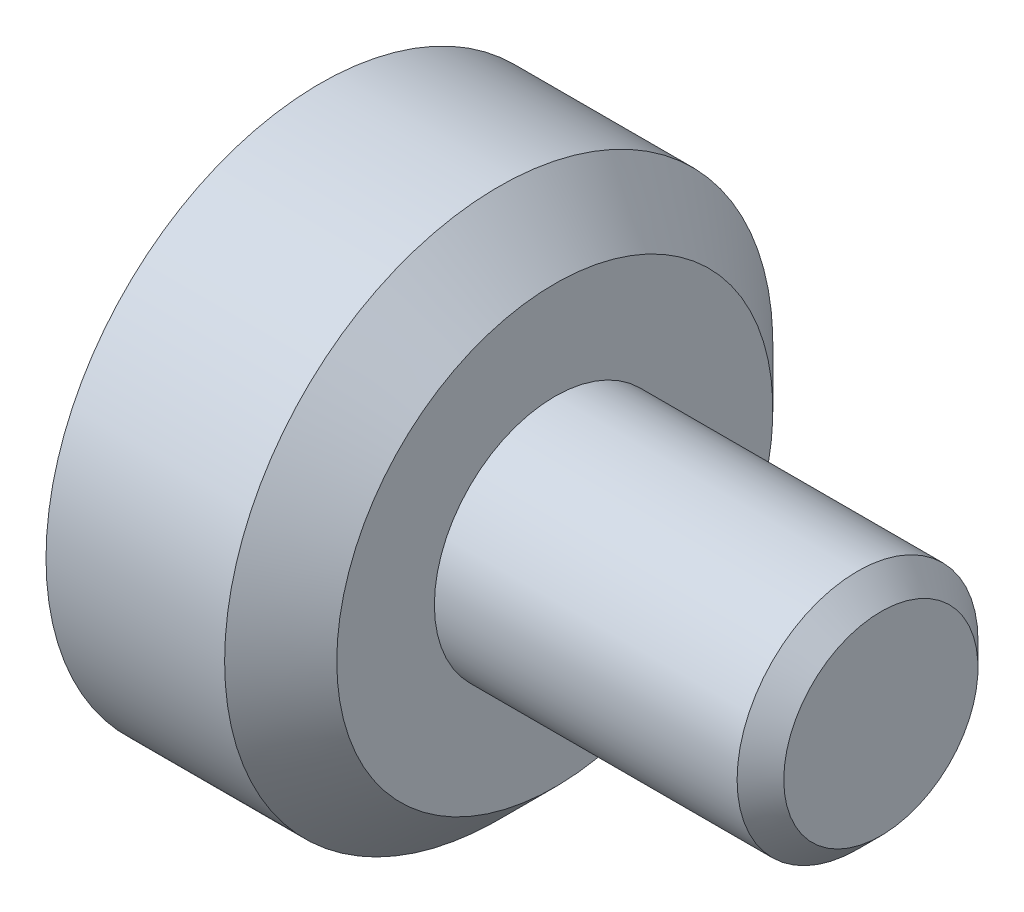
ISO-10303-21;
HEADER;
FILE_DESCRIPTION(('STEP AP214'),'2;1');
FILE_NAME('part.step','',(''),(''),'','','');
FILE_SCHEMA(('AUTOMOTIVE_DESIGN { 1 0 10303 214 1 1 1 1 }'));
ENDSEC;
DATA;
#1=APPLICATION_CONTEXT('core data for automotive mechanical design processes');
#2=APPLICATION_PROTOCOL_DEFINITION('international standard','automotive_design',2000,#1);
#3=PRODUCT_CONTEXT('',#1,'mechanical');
#4=PRODUCT('Part','Part','',(#3));
#5=PRODUCT_RELATED_PRODUCT_CATEGORY('part','',(#4));
#6=PRODUCT_DEFINITION_FORMATION('','',#4);
#7=PRODUCT_DEFINITION_CONTEXT('part definition',#1,'design');
#8=PRODUCT_DEFINITION('design','',#6,#7);
#9=PRODUCT_DEFINITION_SHAPE('','',#8);
#10=(LENGTH_UNIT() NAMED_UNIT(*) SI_UNIT(.MILLI.,.METRE.));
#11=(NAMED_UNIT(*) PLANE_ANGLE_UNIT() SI_UNIT($,.RADIAN.));
#12=(NAMED_UNIT(*) SI_UNIT($,.STERADIAN.) SOLID_ANGLE_UNIT());
#13=UNCERTAINTY_MEASURE_WITH_UNIT(LENGTH_MEASURE(1.E-05),#10,'distance_accuracy_value','');
#14=(GEOMETRIC_REPRESENTATION_CONTEXT(3) GLOBAL_UNCERTAINTY_ASSIGNED_CONTEXT((#13)) GLOBAL_UNIT_ASSIGNED_CONTEXT((#10,
#11,#12)) REPRESENTATION_CONTEXT('',''));
#15=CARTESIAN_POINT('',(0.,0.,0.));
#16=DIRECTION('',(0.,0.,1.));
#17=DIRECTION('',(1.,0.,0.));
#18=AXIS2_PLACEMENT_3D('',#15,#16,#17);
#19=CARTESIAN_POINT('',(-42.0062518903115,0.,0.));
#20=DIRECTION('',(1.,0.,0.));
#21=DIRECTION('',(0.,0.,-1.));
#22=AXIS2_PLACEMENT_3D('',#19,#20,#21);
#23=PLANE('',#22);
#24=CARTESIAN_POINT('',(-42.0062518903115,0.,0.));
#25=DIRECTION('',(-1.,0.,0.));
#26=DIRECTION('',(0.,0.,1.));
#27=AXIS2_PLACEMENT_3D('',#24,#25,#26);
#28=CIRCLE('',#27,58.7200549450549);
#29=CARTESIAN_POINT('',(-42.0062518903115,0.,58.7200549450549));
#30=VERTEX_POINT('',#29);
#31=EDGE_CURVE('E42',#30,#30,#28,.T.);
#32=ORIENTED_EDGE('',*,*,#31,.T.);
#33=EDGE_LOOP('',(#32));
#34=FACE_BOUND('',#33,.T.);
#35=ADVANCED_FACE('F31',(#34),#23,.F.);
#36=CARTESIAN_POINT('',(-54.4620211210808,0.,0.));
#37=DIRECTION('',(-1.,0.,0.));
#38=DIRECTION('',(0.,0.,1.));
#39=AXIS2_PLACEMENT_3D('',#36,#37,#38);
#40=CYLINDRICAL_SURFACE('',#39,58.7200549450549);
#41=ORIENTED_EDGE('',*,*,#31,.F.);
#42=EDGE_LOOP('',(#41));
#43=FACE_BOUND('',#42,.T.);
#44=CARTESIAN_POINT('',(-3.74924639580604,0.,0.));
#45=DIRECTION('',(-1.,0.,0.));
#46=DIRECTION('',(0.,0.,1.));
#47=AXIS2_PLACEMENT_3D('',#44,#45,#46);
#48=CIRCLE('',#47,58.7200549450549);
#49=CARTESIAN_POINT('',(-3.74924639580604,0.,58.7200549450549));
#50=VERTEX_POINT('',#49);
#51=EDGE_CURVE('E46',#50,#50,#48,.T.);
#52=ORIENTED_EDGE('',*,*,#51,.T.);
#53=EDGE_LOOP('',(#52));
#54=FACE_BOUND('',#53,.T.);
#55=ADVANCED_FACE('F73',(#43,#54),#40,.T.);
#56=CARTESIAN_POINT('',(8.26167393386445,0.,0.));
#57=DIRECTION('',(-1.,0.,0.));
#58=DIRECTION('',(0.,0.,1.));
#59=AXIS2_PLACEMENT_3D('',#56,#57,#58);
#60=CONICAL_SURFACE('',#59,46.7091346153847,0.785398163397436);
#61=ORIENTED_EDGE('',*,*,#51,.F.);
#62=EDGE_LOOP('',(#61));
#63=FACE_BOUND('',#62,.T.);
#64=CARTESIAN_POINT('',(8.26167393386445,0.,0.));
#65=DIRECTION('',(-1.,0.,0.));
#66=DIRECTION('',(0.,0.,1.));
#67=AXIS2_PLACEMENT_3D('',#64,#65,#66);
#68=CIRCLE('',#67,46.7091346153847);
#69=CARTESIAN_POINT('',(8.26167393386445,0.,46.7091346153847));
#70=VERTEX_POINT('',#69);
#71=EDGE_CURVE('E51',#70,#70,#68,.T.);
#72=ORIENTED_EDGE('',*,*,#71,.T.);
#73=EDGE_LOOP('',(#72));
#74=FACE_BOUND('',#73,.T.);
#75=ADVANCED_FACE('F69',(#63,#74),#60,.T.);
#76=CARTESIAN_POINT('',(8.26167393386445,46.7091346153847,0.));
#77=DIRECTION('',(-1.,0.,0.));
#78=DIRECTION('',(0.,0.,1.));
#79=AXIS2_PLACEMENT_3D('',#76,#77,#78);
#80=PLANE('',#79);
#81=ORIENTED_EDGE('',*,*,#71,.F.);
#82=EDGE_LOOP('',(#81));
#83=FACE_BOUND('',#82,.T.);
#84=CARTESIAN_POINT('',(8.26167393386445,0.,0.));
#85=DIRECTION('',(-1.,0.,0.));
#86=DIRECTION('',(0.,0.,1.));
#87=AXIS2_PLACEMENT_3D('',#84,#85,#86);
#88=CIRCLE('',#87,25.8012362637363);
#89=CARTESIAN_POINT('',(8.26167393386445,0.,25.8012362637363));
#90=VERTEX_POINT('',#89);
#91=EDGE_CURVE('E54',#90,#90,#88,.T.);
#92=ORIENTED_EDGE('',*,*,#91,.T.);
#93=EDGE_LOOP('',(#92));
#94=FACE_BOUND('',#93,.T.);
#95=ADVANCED_FACE('F58',(#83,#94),#80,.F.);
#96=CARTESIAN_POINT('',(-54.4620211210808,0.,0.));
#97=DIRECTION('',(-1.,0.,0.));
#98=DIRECTION('',(0.,0.,1.));
#99=AXIS2_PLACEMENT_3D('',#96,#97,#98);
#100=CYLINDRICAL_SURFACE('',#99,25.8012362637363);
#101=CARTESIAN_POINT('',(73.1029514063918,0.,0.));
#102=DIRECTION('',(-1.,0.,0.));
#103=DIRECTION('',(0.,0.,1.));
#104=AXIS2_PLACEMENT_3D('',#101,#102,#103);
#105=CIRCLE('',#104,25.8012362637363);
#106=CARTESIAN_POINT('',(73.1029514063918,0.,25.8012362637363));
#107=VERTEX_POINT('',#106);
#108=EDGE_CURVE('E38',#107,#107,#105,.T.);
#109=ORIENTED_EDGE('',*,*,#108,.T.);
#110=EDGE_LOOP('',(#109));
#111=FACE_BOUND('',#110,.T.);
#112=ORIENTED_EDGE('',*,*,#91,.F.);
#113=EDGE_LOOP('',(#112));
#114=FACE_BOUND('',#113,.T.);
#115=ADVANCED_FACE('F60',(#111,#114),#100,.T.);
#116=CARTESIAN_POINT('',(78.1029514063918,25.8012362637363,0.));
#117=DIRECTION('',(-1.,0.,0.));
#118=DIRECTION('',(0.,0.,1.));
#119=AXIS2_PLACEMENT_3D('',#116,#117,#118);
#120=PLANE('',#119);
#121=CARTESIAN_POINT('',(78.1029514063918,0.,0.));
#122=DIRECTION('',(-1.,0.,0.));
#123=DIRECTION('',(0.,0.,1.));
#124=AXIS2_PLACEMENT_3D('',#121,#122,#123);
#125=CIRCLE('',#124,20.8012362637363);
#126=CARTESIAN_POINT('',(78.1029514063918,0.,20.8012362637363));
#127=VERTEX_POINT('',#126);
#128=EDGE_CURVE('E10',#127,#127,#125,.F.);
#129=ORIENTED_EDGE('',*,*,#128,.T.);
#130=EDGE_LOOP('',(#129));
#131=FACE_BOUND('',#130,.T.);
#132=ADVANCED_FACE('F62',(#131),#120,.F.);
#133=CARTESIAN_POINT('',(73.1029514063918,0.,0.));
#134=DIRECTION('',(-1.,0.,0.));
#135=DIRECTION('',(0.,0.,1.));
#136=AXIS2_PLACEMENT_3D('',#133,#134,#135);
#137=CONICAL_SURFACE('',#136,25.8012362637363,0.785398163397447);
#138=ORIENTED_EDGE('',*,*,#128,.F.);
#139=EDGE_LOOP('',(#138));
#140=FACE_BOUND('',#139,.T.);
#141=ORIENTED_EDGE('',*,*,#108,.F.);
#142=EDGE_LOOP('',(#141));
#143=FACE_BOUND('',#142,.T.);
#144=ADVANCED_FACE('F33',(#140,#143),#137,.T.);
#145=CLOSED_SHELL('',(#35,#55,#75,#95,#115,#132,#144));
#146=MANIFOLD_SOLID_BREP('B2',#145);
#147=ADVANCED_BREP_SHAPE_REPRESENTATION('',(#18,#146),#14);
#148=SHAPE_DEFINITION_REPRESENTATION(#9,#147);
ENDSEC;
END-ISO-10303-21;
